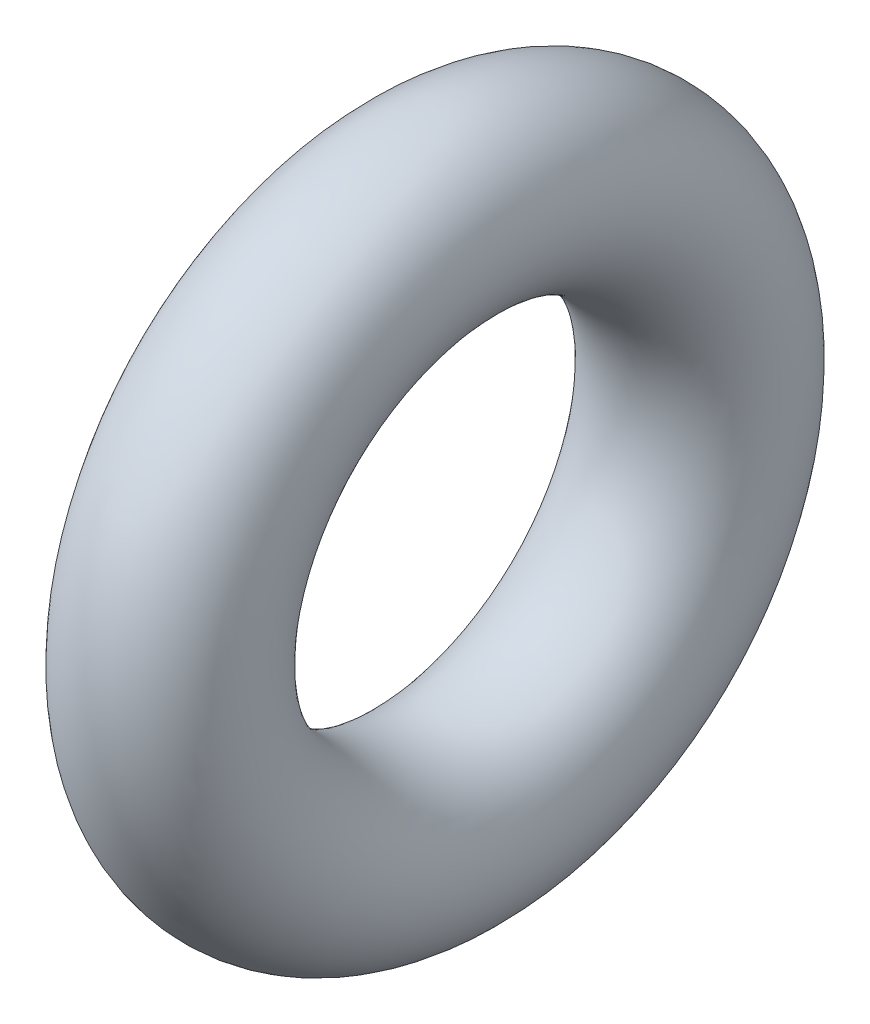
ISO-10303-21;
HEADER;
FILE_DESCRIPTION(('STEP AP214'),'2;1');
FILE_NAME('part.step','',(''),(''),'','','');
FILE_SCHEMA(('AUTOMOTIVE_DESIGN { 1 0 10303 214 1 1 1 1 }'));
ENDSEC;
DATA;
#1=APPLICATION_CONTEXT('core data for automotive mechanical design processes');
#2=APPLICATION_PROTOCOL_DEFINITION('international standard','automotive_design',2000,#1);
#3=PRODUCT_CONTEXT('',#1,'mechanical');
#4=PRODUCT('Part','Part','',(#3));
#5=PRODUCT_RELATED_PRODUCT_CATEGORY('part','',(#4));
#6=PRODUCT_DEFINITION_FORMATION('','',#4);
#7=PRODUCT_DEFINITION_CONTEXT('part definition',#1,'design');
#8=PRODUCT_DEFINITION('design','',#6,#7);
#9=PRODUCT_DEFINITION_SHAPE('','',#8);
#10=(LENGTH_UNIT() NAMED_UNIT(*) SI_UNIT(.MILLI.,.METRE.));
#11=(NAMED_UNIT(*) PLANE_ANGLE_UNIT() SI_UNIT($,.RADIAN.));
#12=(NAMED_UNIT(*) SI_UNIT($,.STERADIAN.) SOLID_ANGLE_UNIT());
#13=UNCERTAINTY_MEASURE_WITH_UNIT(LENGTH_MEASURE(1.E-05),#10,'distance_accuracy_value','');
#14=(GEOMETRIC_REPRESENTATION_CONTEXT(3) GLOBAL_UNCERTAINTY_ASSIGNED_CONTEXT((#13)) GLOBAL_UNIT_ASSIGNED_CONTEXT((#10,
#11,#12)) REPRESENTATION_CONTEXT('',''));
#15=CARTESIAN_POINT('',(0.,0.,0.));
#16=DIRECTION('',(0.,0.,1.));
#17=DIRECTION('',(1.,0.,0.));
#18=AXIS2_PLACEMENT_3D('',#15,#16,#17);
#19=CARTESIAN_POINT('',(4.5,0.,0.));
#20=DIRECTION('',(1.,0.,0.));
#21=DIRECTION('',(0.,-1.,0.));
#22=AXIS2_PLACEMENT_3D('',#19,#20,#21);
#23=TOROIDAL_SURFACE('',#22,10.025,3.33333333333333);
#24=CARTESIAN_POINT('',(4.5,-13.3583333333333,0.));
#25=VERTEX_POINT('',#24);
#26=VERTEX_LOOP('',#25);
#27=FACE_BOUND('',#26,.T.);
#28=ADVANCED_FACE('F13',(#27),#23,.T.);
#29=CLOSED_SHELL('',(#28));
#30=MANIFOLD_SOLID_BREP('B1',#29);
#31=ADVANCED_BREP_SHAPE_REPRESENTATION('',(#18,#30),#14);
#32=SHAPE_DEFINITION_REPRESENTATION(#9,#31);
ENDSEC;
END-ISO-10303-21;
